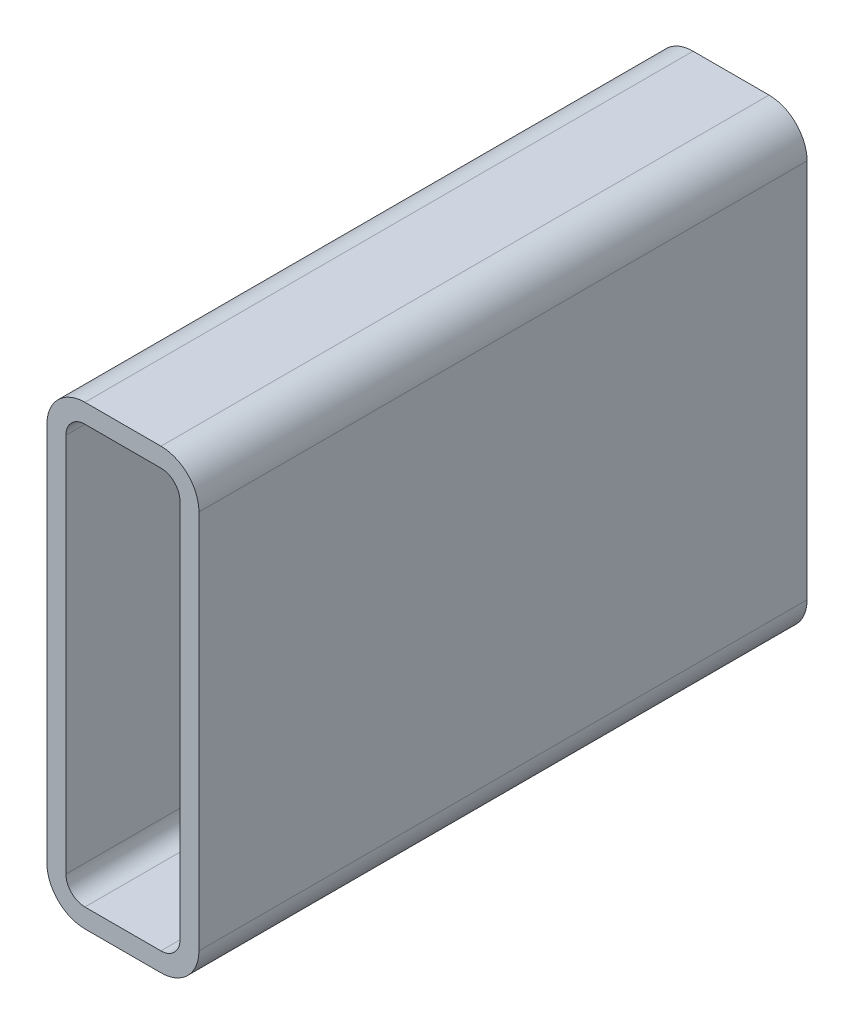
ISO-10303-21;
HEADER;
FILE_DESCRIPTION(('STEP AP214'),'2;1');
FILE_NAME('part.step','',(''),(''),'','','');
FILE_SCHEMA(('AUTOMOTIVE_DESIGN { 1 0 10303 214 1 1 1 1 }'));
ENDSEC;
DATA;
#1=APPLICATION_CONTEXT('core data for automotive mechanical design processes');
#2=APPLICATION_PROTOCOL_DEFINITION('international standard','automotive_design',2000,#1);
#3=PRODUCT_CONTEXT('',#1,'mechanical');
#4=PRODUCT('Part','Part','',(#3));
#5=PRODUCT_RELATED_PRODUCT_CATEGORY('part','',(#4));
#6=PRODUCT_DEFINITION_FORMATION('','',#4);
#7=PRODUCT_DEFINITION_CONTEXT('part definition',#1,'design');
#8=PRODUCT_DEFINITION('design','',#6,#7);
#9=PRODUCT_DEFINITION_SHAPE('','',#8);
#10=(LENGTH_UNIT() NAMED_UNIT(*) SI_UNIT(.MILLI.,.METRE.));
#11=(NAMED_UNIT(*) PLANE_ANGLE_UNIT() SI_UNIT($,.RADIAN.));
#12=(NAMED_UNIT(*) SI_UNIT($,.STERADIAN.) SOLID_ANGLE_UNIT());
#13=UNCERTAINTY_MEASURE_WITH_UNIT(LENGTH_MEASURE(1.E-05),#10,'distance_accuracy_value','');
#14=(GEOMETRIC_REPRESENTATION_CONTEXT(3) GLOBAL_UNCERTAINTY_ASSIGNED_CONTEXT((#13)) GLOBAL_UNIT_ASSIGNED_CONTEXT((#10,
#11,#12)) REPRESENTATION_CONTEXT('',''));
#15=CARTESIAN_POINT('',(0.,0.,0.));
#16=DIRECTION('',(0.,0.,1.));
#17=DIRECTION('',(1.,0.,0.));
#18=AXIS2_PLACEMENT_3D('',#15,#16,#17);
#19=CARTESIAN_POINT('',(21.5391160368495,211.493222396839,304.8));
#20=DIRECTION('',(0.,0.,1.));
#21=DIRECTION('',(1.,0.,0.));
#22=AXIS2_PLACEMENT_3D('',#19,#20,#21);
#23=PLANE('',#22);
#24=CARTESIAN_POINT('',(21.5391160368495,211.493222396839,304.8));
#25=DIRECTION('',(0.,0.,1.));
#26=DIRECTION('',(1.,0.,0.));
#27=AXIS2_PLACEMENT_3D('',#24,#25,#26);
#28=CIRCLE('',#27,19.05);
#29=CARTESIAN_POINT('',(21.5391160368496,230.543222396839,304.8));
#30=VERTEX_POINT('',#29);
#31=CARTESIAN_POINT('',(2.48911603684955,211.493222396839,304.8));
#32=VERTEX_POINT('',#31);
#33=EDGE_CURVE('E211',#30,#32,#28,.T.);
#34=ORIENTED_EDGE('',*,*,#33,.T.);
#35=DIRECTION('',(0.,-1.,0.));
#36=VECTOR('',#35,1.);
#37=CARTESIAN_POINT('',(2.48911603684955,20.9932223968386,304.8));
#38=LINE('',#37,#36);
#39=CARTESIAN_POINT('',(2.48911603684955,20.9932223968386,304.8));
#40=VERTEX_POINT('',#39);
#41=EDGE_CURVE('E214',#32,#40,#38,.T.);
#42=ORIENTED_EDGE('',*,*,#41,.T.);
#43=CARTESIAN_POINT('',(21.5391160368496,20.9932223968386,304.8));
#44=DIRECTION('',(0.,0.,1.));
#45=DIRECTION('',(1.,0.,0.));
#46=AXIS2_PLACEMENT_3D('',#43,#44,#45);
#47=CIRCLE('',#46,19.05);
#48=CARTESIAN_POINT('',(21.5391160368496,1.94322239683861,304.8));
#49=VERTEX_POINT('',#48);
#50=EDGE_CURVE('E217',#40,#49,#47,.T.);
#51=ORIENTED_EDGE('',*,*,#50,.T.);
#52=DIRECTION('',(1.,0.,0.));
#53=VECTOR('',#52,1.);
#54=CARTESIAN_POINT('',(59.6391160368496,1.94322239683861,304.8));
#55=LINE('',#54,#53);
#56=CARTESIAN_POINT('',(59.6391160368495,1.94322239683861,304.8));
#57=VERTEX_POINT('',#56);
#58=EDGE_CURVE('E219',#49,#57,#55,.T.);
#59=ORIENTED_EDGE('',*,*,#58,.T.);
#60=CARTESIAN_POINT('',(59.6391160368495,20.9932223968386,304.8));
#61=DIRECTION('',(0.,0.,1.));
#62=DIRECTION('',(1.,0.,0.));
#63=AXIS2_PLACEMENT_3D('',#60,#61,#62);
#64=CIRCLE('',#63,19.05);
#65=CARTESIAN_POINT('',(78.6891160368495,20.9932223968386,304.8));
#66=VERTEX_POINT('',#65);
#67=EDGE_CURVE('E221',#57,#66,#64,.T.);
#68=ORIENTED_EDGE('',*,*,#67,.T.);
#69=DIRECTION('',(0.,1.,0.));
#70=VECTOR('',#69,1.);
#71=CARTESIAN_POINT('',(78.6891160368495,211.493222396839,304.8));
#72=LINE('',#71,#70);
#73=CARTESIAN_POINT('',(78.6891160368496,211.493222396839,304.8));
#74=VERTEX_POINT('',#73);
#75=EDGE_CURVE('E223',#66,#74,#72,.T.);
#76=ORIENTED_EDGE('',*,*,#75,.T.);
#77=CARTESIAN_POINT('',(59.6391160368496,211.493222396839,304.8));
#78=DIRECTION('',(0.,0.,1.));
#79=DIRECTION('',(1.,0.,0.));
#80=AXIS2_PLACEMENT_3D('',#77,#78,#79);
#81=CIRCLE('',#80,19.05);
#82=CARTESIAN_POINT('',(59.6391160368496,230.543222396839,304.8));
#83=VERTEX_POINT('',#82);
#84=EDGE_CURVE('E225',#74,#83,#81,.T.);
#85=ORIENTED_EDGE('',*,*,#84,.T.);
#86=DIRECTION('',(-1.,0.,0.));
#87=VECTOR('',#86,1.);
#88=CARTESIAN_POINT('',(21.5391160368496,230.543222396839,304.8));
#89=LINE('',#88,#87);
#90=EDGE_CURVE('E227',#83,#30,#89,.T.);
#91=ORIENTED_EDGE('',*,*,#90,.T.);
#92=EDGE_LOOP('',(#34,#42,#51,#59,#68,#76,#85,#91));
#93=FACE_BOUND('',#92,.T.);
#94=DIRECTION('',(0.,-1.,0.));
#95=VECTOR('',#94,1.);
#96=CARTESIAN_POINT('',(12.0141160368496,20.9932223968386,304.8));
#97=LINE('',#96,#95);
#98=CARTESIAN_POINT('',(12.0141160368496,211.493222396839,304.8));
#99=VERTEX_POINT('',#98);
#100=CARTESIAN_POINT('',(12.0141160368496,20.9932223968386,304.8));
#101=VERTEX_POINT('',#100);
#102=EDGE_CURVE('E154',#99,#101,#97,.T.);
#103=ORIENTED_EDGE('',*,*,#102,.F.);
#104=CARTESIAN_POINT('',(21.5391160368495,211.493222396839,304.8));
#105=DIRECTION('',(0.,0.,1.));
#106=DIRECTION('',(1.,0.,0.));
#107=AXIS2_PLACEMENT_3D('',#104,#105,#106);
#108=CIRCLE('',#107,9.525);
#109=CARTESIAN_POINT('',(21.5391160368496,221.018222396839,304.8));
#110=VERTEX_POINT('',#109);
#111=EDGE_CURVE('E146',#110,#99,#108,.T.);
#112=ORIENTED_EDGE('',*,*,#111,.F.);
#113=DIRECTION('',(-1.,0.,0.));
#114=VECTOR('',#113,1.);
#115=CARTESIAN_POINT('',(21.5391160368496,221.018222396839,304.8));
#116=LINE('',#115,#114);
#117=CARTESIAN_POINT('',(59.6391160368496,221.018222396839,304.8));
#118=VERTEX_POINT('',#117);
#119=EDGE_CURVE('E179',#118,#110,#116,.T.);
#120=ORIENTED_EDGE('',*,*,#119,.F.);
#121=CARTESIAN_POINT('',(59.6391160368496,211.493222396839,304.8));
#122=DIRECTION('',(0.,0.,1.));
#123=DIRECTION('',(1.,0.,0.));
#124=AXIS2_PLACEMENT_3D('',#121,#122,#123);
#125=CIRCLE('',#124,9.525);
#126=CARTESIAN_POINT('',(69.1641160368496,211.493222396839,304.8));
#127=VERTEX_POINT('',#126);
#128=EDGE_CURVE('E177',#127,#118,#125,.T.);
#129=ORIENTED_EDGE('',*,*,#128,.F.);
#130=DIRECTION('',(0.,1.,0.));
#131=VECTOR('',#130,1.);
#132=CARTESIAN_POINT('',(69.1641160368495,211.493222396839,304.8));
#133=LINE('',#132,#131);
#134=CARTESIAN_POINT('',(69.1641160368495,20.9932223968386,304.8));
#135=VERTEX_POINT('',#134);
#136=EDGE_CURVE('E175',#135,#127,#133,.T.);
#137=ORIENTED_EDGE('',*,*,#136,.F.);
#138=CARTESIAN_POINT('',(59.6391160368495,20.9932223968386,304.8));
#139=DIRECTION('',(0.,0.,1.));
#140=DIRECTION('',(1.,0.,0.));
#141=AXIS2_PLACEMENT_3D('',#138,#139,#140);
#142=CIRCLE('',#141,9.525);
#143=CARTESIAN_POINT('',(59.6391160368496,11.4682223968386,304.8));
#144=VERTEX_POINT('',#143);
#145=EDGE_CURVE('E173',#144,#135,#142,.T.);
#146=ORIENTED_EDGE('',*,*,#145,.F.);
#147=DIRECTION('',(1.,0.,0.));
#148=VECTOR('',#147,1.);
#149=CARTESIAN_POINT('',(59.6391160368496,11.4682223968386,304.8));
#150=LINE('',#149,#148);
#151=CARTESIAN_POINT('',(21.5391160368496,11.4682223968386,304.8));
#152=VERTEX_POINT('',#151);
#153=EDGE_CURVE('E169',#152,#144,#150,.T.);
#154=ORIENTED_EDGE('',*,*,#153,.F.);
#155=CARTESIAN_POINT('',(21.5391160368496,20.9932223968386,304.8));
#156=DIRECTION('',(0.,0.,1.));
#157=DIRECTION('',(1.,0.,0.));
#158=AXIS2_PLACEMENT_3D('',#155,#156,#157);
#159=CIRCLE('',#158,9.525);
#160=EDGE_CURVE('E167',#101,#152,#159,.T.);
#161=ORIENTED_EDGE('',*,*,#160,.F.);
#162=EDGE_LOOP('',(#103,#112,#120,#129,#137,#146,#154,#161));
#163=FACE_BOUND('',#162,.T.);
#164=ADVANCED_FACE('F33',(#93,#163),#23,.T.);
#165=CARTESIAN_POINT('',(21.5391160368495,211.493222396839,0.));
#166=DIRECTION('',(0.,0.,1.));
#167=DIRECTION('',(1.,0.,0.));
#168=AXIS2_PLACEMENT_3D('',#165,#166,#167);
#169=PLANE('',#168);
#170=CARTESIAN_POINT('',(21.5391160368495,211.493222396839,0.));
#171=DIRECTION('',(0.,0.,1.));
#172=DIRECTION('',(1.,0.,0.));
#173=AXIS2_PLACEMENT_3D('',#170,#171,#172);
#174=CIRCLE('',#173,19.05);
#175=CARTESIAN_POINT('',(21.5391160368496,230.543222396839,0.));
#176=VERTEX_POINT('',#175);
#177=CARTESIAN_POINT('',(2.48911603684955,211.493222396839,0.));
#178=VERTEX_POINT('',#177);
#179=EDGE_CURVE('E162',#176,#178,#174,.T.);
#180=ORIENTED_EDGE('',*,*,#179,.F.);
#181=DIRECTION('',(-1.,0.,0.));
#182=VECTOR('',#181,1.);
#183=CARTESIAN_POINT('',(21.5391160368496,230.543222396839,0.));
#184=LINE('',#183,#182);
#185=CARTESIAN_POINT('',(59.6391160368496,230.543222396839,0.));
#186=VERTEX_POINT('',#185);
#187=EDGE_CURVE('E215',#186,#176,#184,.T.);
#188=ORIENTED_EDGE('',*,*,#187,.F.);
#189=CARTESIAN_POINT('',(59.6391160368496,211.493222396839,0.));
#190=DIRECTION('',(0.,0.,1.));
#191=DIRECTION('',(1.,0.,0.));
#192=AXIS2_PLACEMENT_3D('',#189,#190,#191);
#193=CIRCLE('',#192,19.05);
#194=CARTESIAN_POINT('',(78.6891160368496,211.493222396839,0.));
#195=VERTEX_POINT('',#194);
#196=EDGE_CURVE('E242',#195,#186,#193,.T.);
#197=ORIENTED_EDGE('',*,*,#196,.F.);
#198=DIRECTION('',(0.,1.,0.));
#199=VECTOR('',#198,1.);
#200=CARTESIAN_POINT('',(78.6891160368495,211.493222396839,0.));
#201=LINE('',#200,#199);
#202=CARTESIAN_POINT('',(78.6891160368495,20.9932223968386,0.));
#203=VERTEX_POINT('',#202);
#204=EDGE_CURVE('E240',#203,#195,#201,.T.);
#205=ORIENTED_EDGE('',*,*,#204,.F.);
#206=CARTESIAN_POINT('',(59.6391160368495,20.9932223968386,0.));
#207=DIRECTION('',(0.,0.,1.));
#208=DIRECTION('',(1.,0.,0.));
#209=AXIS2_PLACEMENT_3D('',#206,#207,#208);
#210=CIRCLE('',#209,19.05);
#211=CARTESIAN_POINT('',(59.6391160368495,1.94322239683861,0.));
#212=VERTEX_POINT('',#211);
#213=EDGE_CURVE('E238',#212,#203,#210,.T.);
#214=ORIENTED_EDGE('',*,*,#213,.F.);
#215=DIRECTION('',(1.,0.,0.));
#216=VECTOR('',#215,1.);
#217=CARTESIAN_POINT('',(59.6391160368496,1.94322239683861,0.));
#218=LINE('',#217,#216);
#219=CARTESIAN_POINT('',(21.5391160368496,1.94322239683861,0.));
#220=VERTEX_POINT('',#219);
#221=EDGE_CURVE('E236',#220,#212,#218,.T.);
#222=ORIENTED_EDGE('',*,*,#221,.F.);
#223=CARTESIAN_POINT('',(21.5391160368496,20.9932223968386,0.));
#224=DIRECTION('',(0.,0.,1.));
#225=DIRECTION('',(1.,0.,0.));
#226=AXIS2_PLACEMENT_3D('',#223,#224,#225);
#227=CIRCLE('',#226,19.05);
#228=CARTESIAN_POINT('',(2.48911603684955,20.9932223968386,0.));
#229=VERTEX_POINT('',#228);
#230=EDGE_CURVE('E234',#229,#220,#227,.T.);
#231=ORIENTED_EDGE('',*,*,#230,.F.);
#232=DIRECTION('',(0.,-1.,0.));
#233=VECTOR('',#232,1.);
#234=CARTESIAN_POINT('',(2.48911603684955,20.9932223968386,0.));
#235=LINE('',#234,#233);
#236=EDGE_CURVE('E232',#178,#229,#235,.T.);
#237=ORIENTED_EDGE('',*,*,#236,.F.);
#238=EDGE_LOOP('',(#180,#188,#197,#205,#214,#222,#231,#237));
#239=FACE_BOUND('',#238,.T.);
#240=CARTESIAN_POINT('',(21.5391160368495,211.493222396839,0.));
#241=DIRECTION('',(0.,0.,1.));
#242=DIRECTION('',(1.,0.,0.));
#243=AXIS2_PLACEMENT_3D('',#240,#241,#242);
#244=CIRCLE('',#243,9.525);
#245=CARTESIAN_POINT('',(21.5391160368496,221.018222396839,0.));
#246=VERTEX_POINT('',#245);
#247=CARTESIAN_POINT('',(12.0141160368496,211.493222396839,0.));
#248=VERTEX_POINT('',#247);
#249=EDGE_CURVE('E56',#246,#248,#244,.T.);
#250=ORIENTED_EDGE('',*,*,#249,.T.);
#251=DIRECTION('',(0.,-1.,0.));
#252=VECTOR('',#251,1.);
#253=CARTESIAN_POINT('',(12.0141160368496,20.9932223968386,0.));
#254=LINE('',#253,#252);
#255=CARTESIAN_POINT('',(12.0141160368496,20.9932223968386,0.));
#256=VERTEX_POINT('',#255);
#257=EDGE_CURVE('E161',#248,#256,#254,.T.);
#258=ORIENTED_EDGE('',*,*,#257,.T.);
#259=CARTESIAN_POINT('',(21.5391160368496,20.9932223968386,0.));
#260=DIRECTION('',(0.,0.,1.));
#261=DIRECTION('',(1.,0.,0.));
#262=AXIS2_PLACEMENT_3D('',#259,#260,#261);
#263=CIRCLE('',#262,9.525);
#264=CARTESIAN_POINT('',(21.5391160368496,11.4682223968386,0.));
#265=VERTEX_POINT('',#264);
#266=EDGE_CURVE('E183',#256,#265,#263,.T.);
#267=ORIENTED_EDGE('',*,*,#266,.T.);
#268=DIRECTION('',(1.,0.,0.));
#269=VECTOR('',#268,1.);
#270=CARTESIAN_POINT('',(59.6391160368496,11.4682223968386,0.));
#271=LINE('',#270,#269);
#272=CARTESIAN_POINT('',(59.6391160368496,11.4682223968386,0.));
#273=VERTEX_POINT('',#272);
#274=EDGE_CURVE('E186',#265,#273,#271,.T.);
#275=ORIENTED_EDGE('',*,*,#274,.T.);
#276=CARTESIAN_POINT('',(59.6391160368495,20.9932223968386,0.));
#277=DIRECTION('',(0.,0.,1.));
#278=DIRECTION('',(1.,0.,0.));
#279=AXIS2_PLACEMENT_3D('',#276,#277,#278);
#280=CIRCLE('',#279,9.525);
#281=CARTESIAN_POINT('',(69.1641160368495,20.9932223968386,0.));
#282=VERTEX_POINT('',#281);
#283=EDGE_CURVE('E189',#273,#282,#280,.T.);
#284=ORIENTED_EDGE('',*,*,#283,.T.);
#285=DIRECTION('',(0.,1.,0.));
#286=VECTOR('',#285,1.);
#287=CARTESIAN_POINT('',(69.1641160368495,211.493222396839,0.));
#288=LINE('',#287,#286);
#289=CARTESIAN_POINT('',(69.1641160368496,211.493222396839,0.));
#290=VERTEX_POINT('',#289);
#291=EDGE_CURVE('E192',#282,#290,#288,.T.);
#292=ORIENTED_EDGE('',*,*,#291,.T.);
#293=CARTESIAN_POINT('',(59.6391160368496,211.493222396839,0.));
#294=DIRECTION('',(0.,0.,1.));
#295=DIRECTION('',(1.,0.,0.));
#296=AXIS2_PLACEMENT_3D('',#293,#294,#295);
#297=CIRCLE('',#296,9.525);
#298=CARTESIAN_POINT('',(59.6391160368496,221.018222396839,0.));
#299=VERTEX_POINT('',#298);
#300=EDGE_CURVE('E195',#290,#299,#297,.T.);
#301=ORIENTED_EDGE('',*,*,#300,.T.);
#302=DIRECTION('',(-1.,0.,0.));
#303=VECTOR('',#302,1.);
#304=CARTESIAN_POINT('',(21.5391160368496,221.018222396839,0.));
#305=LINE('',#304,#303);
#306=EDGE_CURVE('E155',#299,#246,#305,.T.);
#307=ORIENTED_EDGE('',*,*,#306,.T.);
#308=EDGE_LOOP('',(#250,#258,#267,#275,#284,#292,#301,#307));
#309=FACE_BOUND('',#308,.T.);
#310=ADVANCED_FACE('F272',(#239,#309),#169,.F.);
#311=CARTESIAN_POINT('',(21.5391160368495,211.493222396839,304.8));
#312=DIRECTION('',(0.,0.,-1.));
#313=DIRECTION('',(-1.,0.,0.));
#314=AXIS2_PLACEMENT_3D('',#311,#312,#313);
#315=CYLINDRICAL_SURFACE('',#314,19.05);
#316=ORIENTED_EDGE('',*,*,#179,.T.);
#317=DIRECTION('',(0.,0.,-1.));
#318=VECTOR('',#317,1.);
#319=CARTESIAN_POINT('',(2.48911603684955,211.493222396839,304.8));
#320=LINE('',#319,#318);
#321=EDGE_CURVE('E11',#32,#178,#320,.T.);
#322=ORIENTED_EDGE('',*,*,#321,.F.);
#323=ORIENTED_EDGE('',*,*,#33,.F.);
#324=DIRECTION('',(0.,0.,-1.));
#325=VECTOR('',#324,1.);
#326=CARTESIAN_POINT('',(21.5391160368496,230.543222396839,304.8));
#327=LINE('',#326,#325);
#328=EDGE_CURVE('E229',#30,#176,#327,.T.);
#329=ORIENTED_EDGE('',*,*,#328,.T.);
#330=EDGE_LOOP('',(#316,#322,#323,#329));
#331=FACE_BOUND('',#330,.T.);
#332=ADVANCED_FACE('F35',(#331),#315,.T.);
#333=CARTESIAN_POINT('',(2.48911603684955,20.9932223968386,304.8));
#334=DIRECTION('',(1.,0.,0.));
#335=DIRECTION('',(0.,0.,-1.));
#336=AXIS2_PLACEMENT_3D('',#333,#334,#335);
#337=PLANE('',#336);
#338=ORIENTED_EDGE('',*,*,#236,.T.);
#339=DIRECTION('',(0.,0.,-1.));
#340=VECTOR('',#339,1.);
#341=CARTESIAN_POINT('',(2.48911603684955,20.9932223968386,304.8));
#342=LINE('',#341,#340);
#343=EDGE_CURVE('E41',#40,#229,#342,.T.);
#344=ORIENTED_EDGE('',*,*,#343,.F.);
#345=ORIENTED_EDGE('',*,*,#41,.F.);
#346=ORIENTED_EDGE('',*,*,#321,.T.);
#347=EDGE_LOOP('',(#338,#344,#345,#346));
#348=FACE_BOUND('',#347,.T.);
#349=ADVANCED_FACE('F289',(#348),#337,.F.);
#350=CARTESIAN_POINT('',(21.5391160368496,20.9932223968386,304.8));
#351=DIRECTION('',(0.,0.,-1.));
#352=DIRECTION('',(-1.,0.,0.));
#353=AXIS2_PLACEMENT_3D('',#350,#351,#352);
#354=CYLINDRICAL_SURFACE('',#353,19.05);
#355=ORIENTED_EDGE('',*,*,#230,.T.);
#356=DIRECTION('',(0.,0.,-1.));
#357=VECTOR('',#356,1.);
#358=CARTESIAN_POINT('',(21.5391160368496,1.94322239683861,304.8));
#359=LINE('',#358,#357);
#360=EDGE_CURVE('E259',#49,#220,#359,.T.);
#361=ORIENTED_EDGE('',*,*,#360,.F.);
#362=ORIENTED_EDGE('',*,*,#50,.F.);
#363=ORIENTED_EDGE('',*,*,#343,.T.);
#364=EDGE_LOOP('',(#355,#361,#362,#363));
#365=FACE_BOUND('',#364,.T.);
#366=ADVANCED_FACE('F266',(#365),#354,.T.);
#367=CARTESIAN_POINT('',(59.6391160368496,1.94322239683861,304.8));
#368=DIRECTION('',(0.,1.,0.));
#369=DIRECTION('',(0.,0.,1.));
#370=AXIS2_PLACEMENT_3D('',#367,#368,#369);
#371=PLANE('',#370);
#372=ORIENTED_EDGE('',*,*,#221,.T.);
#373=DIRECTION('',(0.,0.,-1.));
#374=VECTOR('',#373,1.);
#375=CARTESIAN_POINT('',(59.6391160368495,1.94322239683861,304.8));
#376=LINE('',#375,#374);
#377=EDGE_CURVE('E256',#57,#212,#376,.T.);
#378=ORIENTED_EDGE('',*,*,#377,.F.);
#379=ORIENTED_EDGE('',*,*,#58,.F.);
#380=ORIENTED_EDGE('',*,*,#360,.T.);
#381=EDGE_LOOP('',(#372,#378,#379,#380));
#382=FACE_BOUND('',#381,.T.);
#383=ADVANCED_FACE('F278',(#382),#371,.F.);
#384=CARTESIAN_POINT('',(59.6391160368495,20.9932223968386,304.8));
#385=DIRECTION('',(0.,0.,-1.));
#386=DIRECTION('',(-1.,0.,0.));
#387=AXIS2_PLACEMENT_3D('',#384,#385,#386);
#388=CYLINDRICAL_SURFACE('',#387,19.05);
#389=ORIENTED_EDGE('',*,*,#213,.T.);
#390=DIRECTION('',(0.,0.,-1.));
#391=VECTOR('',#390,1.);
#392=CARTESIAN_POINT('',(78.6891160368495,20.9932223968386,304.8));
#393=LINE('',#392,#391);
#394=EDGE_CURVE('E253',#66,#203,#393,.T.);
#395=ORIENTED_EDGE('',*,*,#394,.F.);
#396=ORIENTED_EDGE('',*,*,#67,.F.);
#397=ORIENTED_EDGE('',*,*,#377,.T.);
#398=EDGE_LOOP('',(#389,#395,#396,#397));
#399=FACE_BOUND('',#398,.T.);
#400=ADVANCED_FACE('F282',(#399),#388,.T.);
#401=CARTESIAN_POINT('',(78.6891160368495,211.493222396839,304.8));
#402=DIRECTION('',(-1.,0.,0.));
#403=DIRECTION('',(0.,0.,1.));
#404=AXIS2_PLACEMENT_3D('',#401,#402,#403);
#405=PLANE('',#404);
#406=ORIENTED_EDGE('',*,*,#204,.T.);
#407=DIRECTION('',(0.,0.,-1.));
#408=VECTOR('',#407,1.);
#409=CARTESIAN_POINT('',(78.6891160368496,211.493222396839,304.8));
#410=LINE('',#409,#408);
#411=EDGE_CURVE('E250',#74,#195,#410,.T.);
#412=ORIENTED_EDGE('',*,*,#411,.F.);
#413=ORIENTED_EDGE('',*,*,#75,.F.);
#414=ORIENTED_EDGE('',*,*,#394,.T.);
#415=EDGE_LOOP('',(#406,#412,#413,#414));
#416=FACE_BOUND('',#415,.T.);
#417=ADVANCED_FACE('F302',(#416),#405,.F.);
#418=CARTESIAN_POINT('',(59.6391160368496,211.493222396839,304.8));
#419=DIRECTION('',(0.,0.,-1.));
#420=DIRECTION('',(-1.,0.,0.));
#421=AXIS2_PLACEMENT_3D('',#418,#419,#420);
#422=CYLINDRICAL_SURFACE('',#421,19.05);
#423=ORIENTED_EDGE('',*,*,#196,.T.);
#424=DIRECTION('',(0.,0.,-1.));
#425=VECTOR('',#424,1.);
#426=CARTESIAN_POINT('',(59.6391160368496,230.543222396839,304.8));
#427=LINE('',#426,#425);
#428=EDGE_CURVE('E247',#83,#186,#427,.T.);
#429=ORIENTED_EDGE('',*,*,#428,.F.);
#430=ORIENTED_EDGE('',*,*,#84,.F.);
#431=ORIENTED_EDGE('',*,*,#411,.T.);
#432=EDGE_LOOP('',(#423,#429,#430,#431));
#433=FACE_BOUND('',#432,.T.);
#434=ADVANCED_FACE('F300',(#433),#422,.T.);
#435=CARTESIAN_POINT('',(21.5391160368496,230.543222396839,304.8));
#436=DIRECTION('',(0.,-1.,0.));
#437=DIRECTION('',(0.,0.,-1.));
#438=AXIS2_PLACEMENT_3D('',#435,#436,#437);
#439=PLANE('',#438);
#440=ORIENTED_EDGE('',*,*,#187,.T.);
#441=ORIENTED_EDGE('',*,*,#328,.F.);
#442=ORIENTED_EDGE('',*,*,#90,.F.);
#443=ORIENTED_EDGE('',*,*,#428,.T.);
#444=EDGE_LOOP('',(#440,#441,#442,#443));
#445=FACE_BOUND('',#444,.T.);
#446=ADVANCED_FACE('F295',(#445),#439,.F.);
#447=CARTESIAN_POINT('',(21.5391160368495,211.493222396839,304.8));
#448=DIRECTION('',(0.,0.,-1.));
#449=DIRECTION('',(-1.,0.,0.));
#450=AXIS2_PLACEMENT_3D('',#447,#448,#449);
#451=CYLINDRICAL_SURFACE('',#450,9.525);
#452=ORIENTED_EDGE('',*,*,#249,.F.);
#453=DIRECTION('',(0.,0.,-1.));
#454=VECTOR('',#453,1.);
#455=CARTESIAN_POINT('',(21.5391160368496,221.018222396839,304.8));
#456=LINE('',#455,#454);
#457=EDGE_CURVE('E150',#110,#246,#456,.T.);
#458=ORIENTED_EDGE('',*,*,#457,.F.);
#459=ORIENTED_EDGE('',*,*,#111,.T.);
#460=DIRECTION('',(0.,0.,-1.));
#461=VECTOR('',#460,1.);
#462=CARTESIAN_POINT('',(12.0141160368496,211.493222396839,304.8));
#463=LINE('',#462,#461);
#464=EDGE_CURVE('E149',#99,#248,#463,.T.);
#465=ORIENTED_EDGE('',*,*,#464,.T.);
#466=EDGE_LOOP('',(#452,#458,#459,#465));
#467=FACE_BOUND('',#466,.T.);
#468=ADVANCED_FACE('F148',(#467),#451,.F.);
#469=CARTESIAN_POINT('',(12.0141160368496,20.9932223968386,304.8));
#470=DIRECTION('',(1.,0.,0.));
#471=DIRECTION('',(0.,0.,-1.));
#472=AXIS2_PLACEMENT_3D('',#469,#470,#471);
#473=PLANE('',#472);
#474=ORIENTED_EDGE('',*,*,#257,.F.);
#475=ORIENTED_EDGE('',*,*,#464,.F.);
#476=ORIENTED_EDGE('',*,*,#102,.T.);
#477=DIRECTION('',(0.,0.,-1.));
#478=VECTOR('',#477,1.);
#479=CARTESIAN_POINT('',(12.0141160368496,20.9932223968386,304.8));
#480=LINE('',#479,#478);
#481=EDGE_CURVE('E163',#101,#256,#480,.T.);
#482=ORIENTED_EDGE('',*,*,#481,.T.);
#483=EDGE_LOOP('',(#474,#475,#476,#482));
#484=FACE_BOUND('',#483,.T.);
#485=ADVANCED_FACE('F158',(#484),#473,.T.);
#486=CARTESIAN_POINT('',(21.5391160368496,20.9932223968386,304.8));
#487=DIRECTION('',(0.,0.,-1.));
#488=DIRECTION('',(-1.,0.,0.));
#489=AXIS2_PLACEMENT_3D('',#486,#487,#488);
#490=CYLINDRICAL_SURFACE('',#489,9.525);
#491=ORIENTED_EDGE('',*,*,#266,.F.);
#492=ORIENTED_EDGE('',*,*,#481,.F.);
#493=ORIENTED_EDGE('',*,*,#160,.T.);
#494=DIRECTION('',(0.,0.,-1.));
#495=VECTOR('',#494,1.);
#496=CARTESIAN_POINT('',(21.5391160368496,11.4682223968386,304.8));
#497=LINE('',#496,#495);
#498=EDGE_CURVE('E208',#152,#265,#497,.T.);
#499=ORIENTED_EDGE('',*,*,#498,.T.);
#500=EDGE_LOOP('',(#491,#492,#493,#499));
#501=FACE_BOUND('',#500,.T.);
#502=ADVANCED_FACE('F327',(#501),#490,.F.);
#503=CARTESIAN_POINT('',(59.6391160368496,11.4682223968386,304.8));
#504=DIRECTION('',(0.,1.,0.));
#505=DIRECTION('',(0.,0.,1.));
#506=AXIS2_PLACEMENT_3D('',#503,#504,#505);
#507=PLANE('',#506);
#508=ORIENTED_EDGE('',*,*,#274,.F.);
#509=ORIENTED_EDGE('',*,*,#498,.F.);
#510=ORIENTED_EDGE('',*,*,#153,.T.);
#511=DIRECTION('',(0.,0.,-1.));
#512=VECTOR('',#511,1.);
#513=CARTESIAN_POINT('',(59.6391160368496,11.4682223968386,304.8));
#514=LINE('',#513,#512);
#515=EDGE_CURVE('E206',#144,#273,#514,.T.);
#516=ORIENTED_EDGE('',*,*,#515,.T.);
#517=EDGE_LOOP('',(#508,#509,#510,#516));
#518=FACE_BOUND('',#517,.T.);
#519=ADVANCED_FACE('F331',(#518),#507,.T.);
#520=CARTESIAN_POINT('',(59.6391160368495,20.9932223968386,304.8));
#521=DIRECTION('',(0.,0.,-1.));
#522=DIRECTION('',(-1.,0.,0.));
#523=AXIS2_PLACEMENT_3D('',#520,#521,#522);
#524=CYLINDRICAL_SURFACE('',#523,9.525);
#525=ORIENTED_EDGE('',*,*,#283,.F.);
#526=ORIENTED_EDGE('',*,*,#515,.F.);
#527=ORIENTED_EDGE('',*,*,#145,.T.);
#528=DIRECTION('',(0.,0.,-1.));
#529=VECTOR('',#528,1.);
#530=CARTESIAN_POINT('',(69.1641160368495,20.9932223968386,304.8));
#531=LINE('',#530,#529);
#532=EDGE_CURVE('E204',#135,#282,#531,.T.);
#533=ORIENTED_EDGE('',*,*,#532,.T.);
#534=EDGE_LOOP('',(#525,#526,#527,#533));
#535=FACE_BOUND('',#534,.T.);
#536=ADVANCED_FACE('F337',(#535),#524,.F.);
#537=CARTESIAN_POINT('',(69.1641160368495,211.493222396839,304.8));
#538=DIRECTION('',(-1.,0.,0.));
#539=DIRECTION('',(0.,0.,1.));
#540=AXIS2_PLACEMENT_3D('',#537,#538,#539);
#541=PLANE('',#540);
#542=ORIENTED_EDGE('',*,*,#291,.F.);
#543=ORIENTED_EDGE('',*,*,#532,.F.);
#544=ORIENTED_EDGE('',*,*,#136,.T.);
#545=DIRECTION('',(0.,0.,-1.));
#546=VECTOR('',#545,1.);
#547=CARTESIAN_POINT('',(69.1641160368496,211.493222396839,304.8));
#548=LINE('',#547,#546);
#549=EDGE_CURVE('E202',#127,#290,#548,.T.);
#550=ORIENTED_EDGE('',*,*,#549,.T.);
#551=EDGE_LOOP('',(#542,#543,#544,#550));
#552=FACE_BOUND('',#551,.T.);
#553=ADVANCED_FACE('F341',(#552),#541,.T.);
#554=CARTESIAN_POINT('',(59.6391160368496,211.493222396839,304.8));
#555=DIRECTION('',(0.,0.,-1.));
#556=DIRECTION('',(-1.,0.,0.));
#557=AXIS2_PLACEMENT_3D('',#554,#555,#556);
#558=CYLINDRICAL_SURFACE('',#557,9.525);
#559=ORIENTED_EDGE('',*,*,#300,.F.);
#560=ORIENTED_EDGE('',*,*,#549,.F.);
#561=ORIENTED_EDGE('',*,*,#128,.T.);
#562=DIRECTION('',(0.,0.,-1.));
#563=VECTOR('',#562,1.);
#564=CARTESIAN_POINT('',(59.6391160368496,221.018222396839,304.8));
#565=LINE('',#564,#563);
#566=EDGE_CURVE('E48',#118,#299,#565,.T.);
#567=ORIENTED_EDGE('',*,*,#566,.T.);
#568=EDGE_LOOP('',(#559,#560,#561,#567));
#569=FACE_BOUND('',#568,.T.);
#570=ADVANCED_FACE('F345',(#569),#558,.F.);
#571=CARTESIAN_POINT('',(21.5391160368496,221.018222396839,304.8));
#572=DIRECTION('',(0.,-1.,0.));
#573=DIRECTION('',(0.,0.,-1.));
#574=AXIS2_PLACEMENT_3D('',#571,#572,#573);
#575=PLANE('',#574);
#576=ORIENTED_EDGE('',*,*,#306,.F.);
#577=ORIENTED_EDGE('',*,*,#566,.F.);
#578=ORIENTED_EDGE('',*,*,#119,.T.);
#579=ORIENTED_EDGE('',*,*,#457,.T.);
#580=EDGE_LOOP('',(#576,#577,#578,#579));
#581=FACE_BOUND('',#580,.T.);
#582=ADVANCED_FACE('F349',(#581),#575,.T.);
#583=CLOSED_SHELL('',(#164,#310,#332,#349,#366,#383,#400,#417,#434,#446,#468,#485,#502,#519,
#536,#553,#570,#582));
#584=MANIFOLD_SOLID_BREP('B2',#583);
#585=ADVANCED_BREP_SHAPE_REPRESENTATION('',(#18,#584),#14);
#586=SHAPE_DEFINITION_REPRESENTATION(#9,#585);
ENDSEC;
END-ISO-10303-21;
